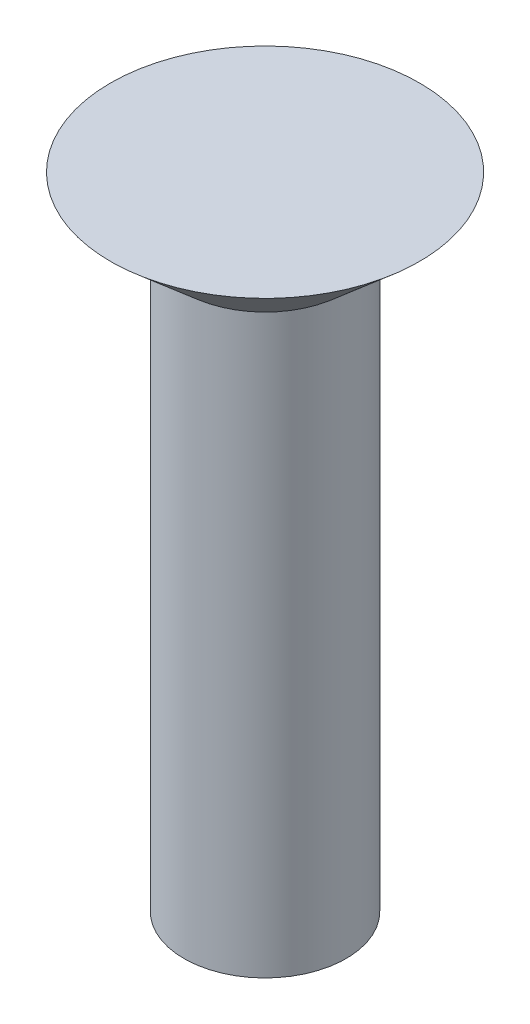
from build123d import *


with BuildPart() as part:
    # Sketch1 → Revolve1 (revolve)
    with BuildSketch(Plane.XY, mode=Mode.PRIVATE) as revolve1_sk:
        Polygon((0, 0), (4.5974, 0), (2.413, -1.89886995), (2.413, -19.05), (0, -19.05), align=None)
    revolve(revolve1_sk.sketch.rotate(Axis((0, 0, 0), (0, -1, 0)), 180), axis=Axis((0, 0, 0), (0, -1, 0)))


solid = part.part
